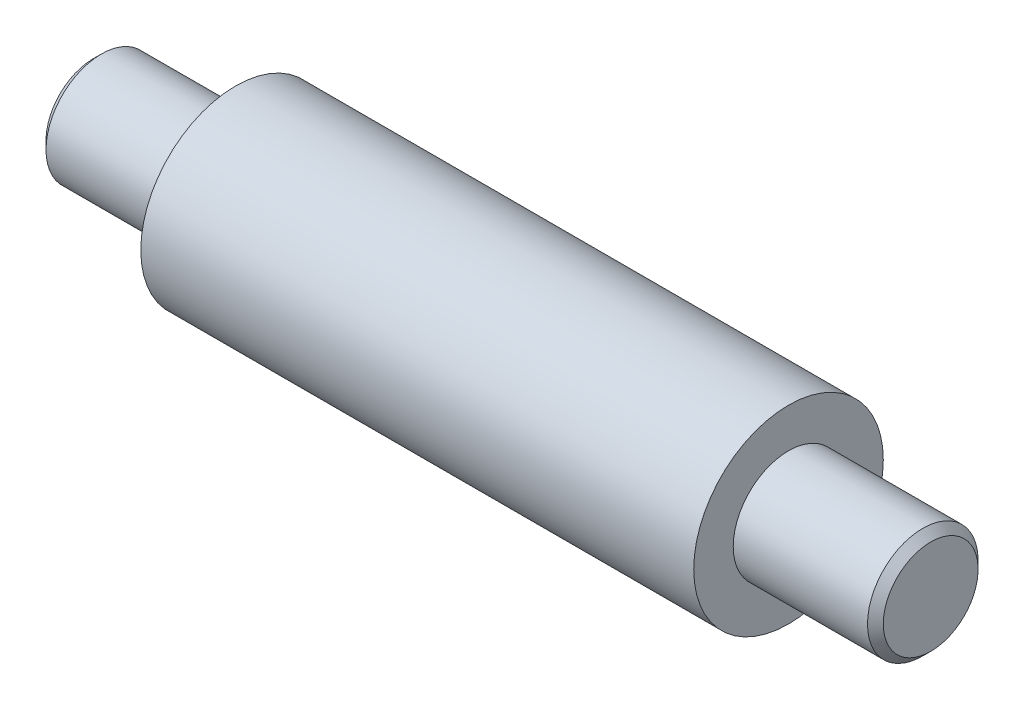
ISO-10303-21;
HEADER;
FILE_DESCRIPTION(('STEP AP214'),'2;1');
FILE_NAME('part.step','',(''),(''),'','','');
FILE_SCHEMA(('AUTOMOTIVE_DESIGN { 1 0 10303 214 1 1 1 1 }'));
ENDSEC;
DATA;
#1=APPLICATION_CONTEXT('core data for automotive mechanical design processes');
#2=APPLICATION_PROTOCOL_DEFINITION('international standard','automotive_design',2000,#1);
#3=PRODUCT_CONTEXT('',#1,'mechanical');
#4=PRODUCT('Part','Part','',(#3));
#5=PRODUCT_RELATED_PRODUCT_CATEGORY('part','',(#4));
#6=PRODUCT_DEFINITION_FORMATION('','',#4);
#7=PRODUCT_DEFINITION_CONTEXT('part definition',#1,'design');
#8=PRODUCT_DEFINITION('design','',#6,#7);
#9=PRODUCT_DEFINITION_SHAPE('','',#8);
#10=(LENGTH_UNIT() NAMED_UNIT(*) SI_UNIT(.MILLI.,.METRE.));
#11=(NAMED_UNIT(*) PLANE_ANGLE_UNIT() SI_UNIT($,.RADIAN.));
#12=(NAMED_UNIT(*) SI_UNIT($,.STERADIAN.) SOLID_ANGLE_UNIT());
#13=UNCERTAINTY_MEASURE_WITH_UNIT(LENGTH_MEASURE(1.E-05),#10,'distance_accuracy_value','');
#14=(GEOMETRIC_REPRESENTATION_CONTEXT(3) GLOBAL_UNCERTAINTY_ASSIGNED_CONTEXT((#13)) GLOBAL_UNIT_ASSIGNED_CONTEXT((#10,
#11,#12)) REPRESENTATION_CONTEXT('',''));
#15=CARTESIAN_POINT('',(0.,0.,0.));
#16=DIRECTION('',(0.,0.,1.));
#17=DIRECTION('',(1.,0.,0.));
#18=AXIS2_PLACEMENT_3D('',#15,#16,#17);
#19=CARTESIAN_POINT('',(0.,7.,0.));
#20=DIRECTION('',(1.,0.,0.));
#21=DIRECTION('',(0.,0.,-1.));
#22=AXIS2_PLACEMENT_3D('',#19,#20,#21);
#23=PLANE('',#22);
#24=CARTESIAN_POINT('',(0.,0.,0.));
#25=DIRECTION('',(1.,0.,0.));
#26=DIRECTION('',(0.,0.,-1.));
#27=AXIS2_PLACEMENT_3D('',#24,#25,#26);
#28=CIRCLE('',#27,6.);
#29=CARTESIAN_POINT('',(0.,0.,-6.));
#30=VERTEX_POINT('',#29);
#31=EDGE_CURVE('E35',#30,#30,#28,.F.);
#32=ORIENTED_EDGE('',*,*,#31,.T.);
#33=EDGE_LOOP('',(#32));
#34=FACE_BOUND('',#33,.T.);
#35=ADVANCED_FACE('F29',(#34),#23,.F.);
#36=CARTESIAN_POINT('',(106.,0.,0.));
#37=DIRECTION('',(-1.,0.,0.));
#38=DIRECTION('',(0.,0.,1.));
#39=AXIS2_PLACEMENT_3D('',#36,#37,#38);
#40=PLANE('',#39);
#41=CARTESIAN_POINT('',(106.,0.,0.));
#42=DIRECTION('',(-1.,0.,0.));
#43=DIRECTION('',(0.,0.,1.));
#44=AXIS2_PLACEMENT_3D('',#41,#42,#43);
#45=CIRCLE('',#44,6.00000000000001);
#46=CARTESIAN_POINT('',(106.,0.,6.00000000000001));
#47=VERTEX_POINT('',#46);
#48=EDGE_CURVE('E39',#47,#47,#45,.F.);
#49=ORIENTED_EDGE('',*,*,#48,.T.);
#50=EDGE_LOOP('',(#49));
#51=FACE_BOUND('',#50,.T.);
#52=ADVANCED_FACE('F83',(#51),#40,.F.);
#53=CARTESIAN_POINT('',(0.,0.,0.));
#54=DIRECTION('',(-1.,0.,0.));
#55=DIRECTION('',(0.,0.,1.));
#56=AXIS2_PLACEMENT_3D('',#53,#54,#55);
#57=CYLINDRICAL_SURFACE('',#56,7.);
#58=CARTESIAN_POINT('',(105.,0.,0.));
#59=DIRECTION('',(-1.,0.,0.));
#60=DIRECTION('',(0.,0.,1.));
#61=AXIS2_PLACEMENT_3D('',#58,#59,#60);
#62=CIRCLE('',#61,7.);
#63=CARTESIAN_POINT('',(105.,0.,7.));
#64=VERTEX_POINT('',#63);
#65=EDGE_CURVE('E43',#64,#64,#62,.T.);
#66=ORIENTED_EDGE('',*,*,#65,.T.);
#67=EDGE_LOOP('',(#66));
#68=FACE_BOUND('',#67,.T.);
#69=CARTESIAN_POINT('',(88.,0.,0.));
#70=DIRECTION('',(-1.,0.,0.));
#71=DIRECTION('',(0.,0.,1.));
#72=AXIS2_PLACEMENT_3D('',#69,#70,#71);
#73=CIRCLE('',#72,7.);
#74=CARTESIAN_POINT('',(88.,0.,7.));
#75=VERTEX_POINT('',#74);
#76=EDGE_CURVE('E48',#75,#75,#73,.T.);
#77=ORIENTED_EDGE('',*,*,#76,.F.);
#78=EDGE_LOOP('',(#77));
#79=FACE_BOUND('',#78,.T.);
#80=ADVANCED_FACE('F78',(#68,#79),#57,.T.);
#81=CARTESIAN_POINT('',(88.,7.,0.));
#82=DIRECTION('',(-1.,0.,0.));
#83=DIRECTION('',(0.,0.,1.));
#84=AXIS2_PLACEMENT_3D('',#81,#82,#83);
#85=PLANE('',#84);
#86=CARTESIAN_POINT('',(88.,0.,0.));
#87=DIRECTION('',(-1.,0.,0.));
#88=DIRECTION('',(0.,0.,1.));
#89=AXIS2_PLACEMENT_3D('',#86,#87,#88);
#90=CIRCLE('',#89,12.);
#91=CARTESIAN_POINT('',(88.,0.,12.));
#92=VERTEX_POINT('',#91);
#93=EDGE_CURVE('E51',#92,#92,#90,.T.);
#94=ORIENTED_EDGE('',*,*,#93,.F.);
#95=EDGE_LOOP('',(#94));
#96=FACE_BOUND('',#95,.T.);
#97=ORIENTED_EDGE('',*,*,#76,.T.);
#98=EDGE_LOOP('',(#97));
#99=FACE_BOUND('',#98,.T.);
#100=ADVANCED_FACE('F72',(#96,#99),#85,.F.);
#101=CARTESIAN_POINT('',(0.,0.,0.));
#102=DIRECTION('',(-1.,0.,0.));
#103=DIRECTION('',(0.,0.,1.));
#104=AXIS2_PLACEMENT_3D('',#101,#102,#103);
#105=CYLINDRICAL_SURFACE('',#104,12.);
#106=CARTESIAN_POINT('',(18.,0.,0.));
#107=DIRECTION('',(-1.,0.,0.));
#108=DIRECTION('',(0.,0.,1.));
#109=AXIS2_PLACEMENT_3D('',#106,#107,#108);
#110=CIRCLE('',#109,12.);
#111=CARTESIAN_POINT('',(18.,0.,12.));
#112=VERTEX_POINT('',#111);
#113=EDGE_CURVE('E54',#112,#112,#110,.T.);
#114=ORIENTED_EDGE('',*,*,#113,.F.);
#115=EDGE_LOOP('',(#114));
#116=FACE_BOUND('',#115,.T.);
#117=ORIENTED_EDGE('',*,*,#93,.T.);
#118=EDGE_LOOP('',(#117));
#119=FACE_BOUND('',#118,.T.);
#120=ADVANCED_FACE('F66',(#116,#119),#105,.T.);
#121=CARTESIAN_POINT('',(18.,12.,0.));
#122=DIRECTION('',(1.,0.,0.));
#123=DIRECTION('',(0.,0.,-1.));
#124=AXIS2_PLACEMENT_3D('',#121,#122,#123);
#125=PLANE('',#124);
#126=CARTESIAN_POINT('',(18.,0.,0.));
#127=DIRECTION('',(-1.,0.,0.));
#128=DIRECTION('',(0.,0.,1.));
#129=AXIS2_PLACEMENT_3D('',#126,#127,#128);
#130=CIRCLE('',#129,7.);
#131=CARTESIAN_POINT('',(18.,0.,7.));
#132=VERTEX_POINT('',#131);
#133=EDGE_CURVE('E57',#132,#132,#130,.T.);
#134=ORIENTED_EDGE('',*,*,#133,.F.);
#135=EDGE_LOOP('',(#134));
#136=FACE_BOUND('',#135,.T.);
#137=ORIENTED_EDGE('',*,*,#113,.T.);
#138=EDGE_LOOP('',(#137));
#139=FACE_BOUND('',#138,.T.);
#140=ADVANCED_FACE('F63',(#136,#139),#125,.F.);
#141=CARTESIAN_POINT('',(0.,0.,0.));
#142=DIRECTION('',(-1.,0.,0.));
#143=DIRECTION('',(0.,0.,1.));
#144=AXIS2_PLACEMENT_3D('',#141,#142,#143);
#145=CYLINDRICAL_SURFACE('',#144,7.);
#146=CARTESIAN_POINT('',(1.00000000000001,0.,0.));
#147=DIRECTION('',(1.,0.,0.));
#148=DIRECTION('',(0.,0.,-1.));
#149=AXIS2_PLACEMENT_3D('',#146,#147,#148);
#150=CIRCLE('',#149,7.);
#151=CARTESIAN_POINT('',(1.00000000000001,0.,-7.));
#152=VERTEX_POINT('',#151);
#153=EDGE_CURVE('E10',#152,#152,#150,.T.);
#154=ORIENTED_EDGE('',*,*,#153,.T.);
#155=EDGE_LOOP('',(#154));
#156=FACE_BOUND('',#155,.T.);
#157=ORIENTED_EDGE('',*,*,#133,.T.);
#158=EDGE_LOOP('',(#157));
#159=FACE_BOUND('',#158,.T.);
#160=ADVANCED_FACE('F61',(#156,#159),#145,.T.);
#161=CARTESIAN_POINT('',(105.,0.,0.));
#162=DIRECTION('',(-1.,0.,0.));
#163=DIRECTION('',(0.,0.,1.));
#164=AXIS2_PLACEMENT_3D('',#161,#162,#163);
#165=CONICAL_SURFACE('',#164,7.,0.785398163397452);
#166=ORIENTED_EDGE('',*,*,#48,.F.);
#167=EDGE_LOOP('',(#166));
#168=FACE_BOUND('',#167,.T.);
#169=ORIENTED_EDGE('',*,*,#65,.F.);
#170=EDGE_LOOP('',(#169));
#171=FACE_BOUND('',#170,.T.);
#172=ADVANCED_FACE('F112',(#168,#171),#165,.T.);
#173=CARTESIAN_POINT('',(0.,0.,0.));
#174=DIRECTION('',(1.,0.,0.));
#175=DIRECTION('',(0.,0.,-1.));
#176=AXIS2_PLACEMENT_3D('',#173,#174,#175);
#177=CONICAL_SURFACE('',#176,6.,0.785398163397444);
#178=ORIENTED_EDGE('',*,*,#153,.F.);
#179=EDGE_LOOP('',(#178));
#180=FACE_BOUND('',#179,.T.);
#181=ORIENTED_EDGE('',*,*,#31,.F.);
#182=EDGE_LOOP('',(#181));
#183=FACE_BOUND('',#182,.T.);
#184=ADVANCED_FACE('F122',(#180,#183),#177,.T.);
#185=CLOSED_SHELL('',(#35,#52,#80,#100,#120,#140,#160,#172,#184));
#186=MANIFOLD_SOLID_BREP('B2',#185);
#187=ADVANCED_BREP_SHAPE_REPRESENTATION('',(#18,#186),#14);
#188=SHAPE_DEFINITION_REPRESENTATION(#9,#187);
ENDSEC;
END-ISO-10303-21;
